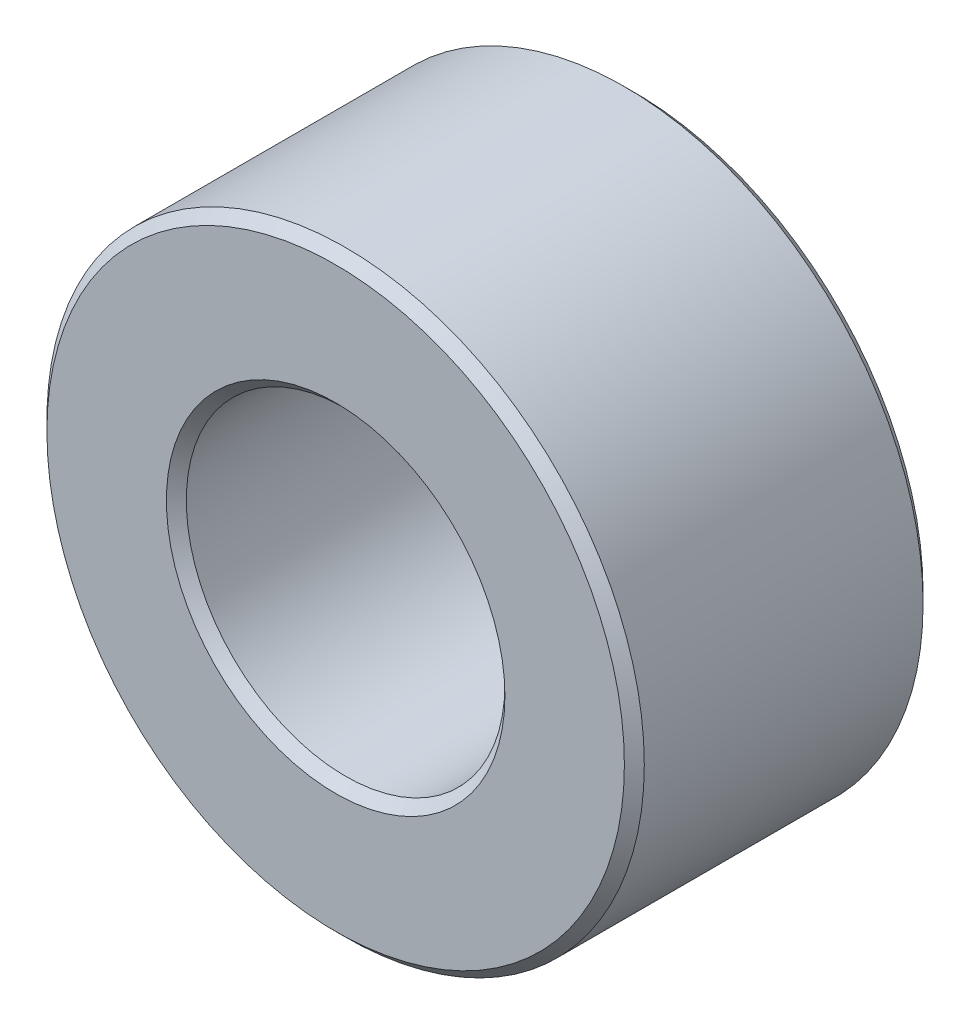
from build123d import *

# Parameters (mm, degrees)
SKETCH1_R           = 3
SKETCH1_R_2         = 1.6
BOSS_EXTRUDE2_DEPTH = 1.5
CHAMFER3_SIZE       = 0.1


with BuildPart() as part:
    # Sketch1 → Boss-Extrude2 (new, symmetric)
    with BuildSketch(Plane.XY):
        Circle(SKETCH1_R)
        Circle(SKETCH1_R_2, mode=Mode.SUBTRACT)
    extrude(amount=BOSS_EXTRUDE2_DEPTH, both=True)

    # Chamfer3
    chamfer3_edges = [part.edges().sort_by_distance(p)[0] for p in [
        (-3, 0, -1.5),
        (-3, 0, 1.5),
        (-1.6, 0, -1.5),
        (-1.6, 0, 1.5),
    ]]
    chamfer(chamfer3_edges, length=CHAMFER3_SIZE)


solid = part.part
